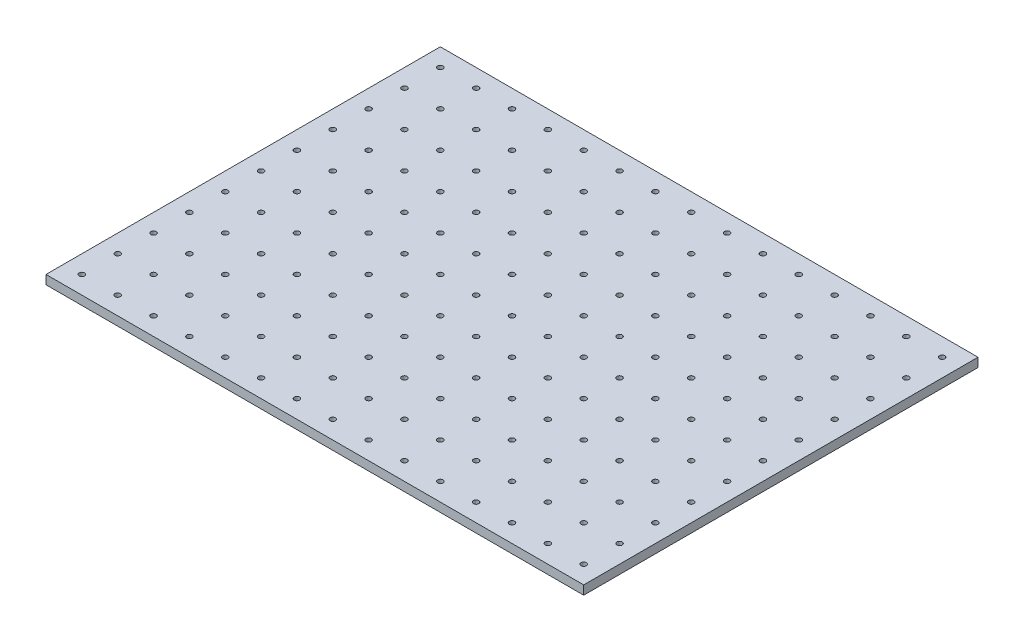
from build123d import *

# Parameters (mm, degrees)
SKETCH1_W           = 300
SKETCH1_H           = 220
SKETCH1_R           = 1.5
BOSS_EXTRUDE1_DEPTH = 5


with BuildPart() as part:
    # Sketch1 → Boss-Extrude1 (new body)
    with BuildSketch(Plane(origin=(0, 0, 0), x_dir=(1, 0, 0), z_dir=(0, 1, 0))):
        Rectangle(SKETCH1_W, SKETCH1_H)
        with Locations(Location((-140, 100, 0), (0, 0, 270))):
            Circle(SKETCH1_R, mode=Mode.SUBTRACT)
        with Locations(Location((-120, 100, 0), (0, 0, 270))):
            Circle(SKETCH1_R, mode=Mode.SUBTRACT)
        with Locations(Location((-100, 100, 0), (0, 0, 270))):
            Circle(SKETCH1_R, mode=Mode.SUBTRACT)
        with Locations(Location((-80, 100, 0), (0, 0, 270))):
            Circle(SKETCH1_R, mode=Mode.SUBTRACT)
        with Locations(Location((-60, 100, 0), (0, 0, 270))):
            Circle(SKETCH1_R, mode=Mode.SUBTRACT)
        with Locations(Location((-40, 100, 0), (0, 0, 270))):
            Circle(SKETCH1_R, mode=Mode.SUBTRACT)
        with Locations(Location((-20, 100, 0), (0, 0, 270))):
            Circle(SKETCH1_R, mode=Mode.SUBTRACT)
        with Locations(Location((0, 100, 0), (0, 0, 270))):
            Circle(SKETCH1_R, mode=Mode.SUBTRACT)
        with Locations(Location((20, 100, 0), (0, 0, 270))):
            Circle(SKETCH1_R, mode=Mode.SUBTRACT)
        with Locations(Location((40, 100, 0), (0, 0, 270))):
            Circle(SKETCH1_R, mode=Mode.SUBTRACT)
        with Locations(Location((60, 100, 0), (0, 0, 270))):
            Circle(SKETCH1_R, mode=Mode.SUBTRACT)
        with Locations(Location((80, 100, 0), (0, 0, 270))):
            Circle(SKETCH1_R, mode=Mode.SUBTRACT)
        with Locations(Location((100, 100, 0), (0, 0, 270))):
            Circle(SKETCH1_R, mode=Mode.SUBTRACT)
        with Locations(Location((120, 100, 0), (0, 0, 270))):
            Circle(SKETCH1_R, mode=Mode.SUBTRACT)
        with Locations(Location((140, 100, 0), (0, 0, 270))):
            Circle(SKETCH1_R, mode=Mode.SUBTRACT)
        with Locations(Location((-120, 80, 0), (0, 0, 270))):
            Circle(SKETCH1_R, mode=Mode.SUBTRACT)
        with Locations(Location((-100, 80, 0), (0, 0, 270))):
            Circle(SKETCH1_R, mode=Mode.SUBTRACT)
        with Locations(Location((-80, 80, 0), (0, 0, 270))):
            Circle(SKETCH1_R, mode=Mode.SUBTRACT)
        with Locations(Location((-60, 80, 0), (0, 0, 270))):
            Circle(SKETCH1_R, mode=Mode.SUBTRACT)
        with Locations(Location((-40, 80, 0), (0, 0, 270))):
            Circle(SKETCH1_R, mode=Mode.SUBTRACT)
        with Locations(Location((-20, 80, 0), (0, 0, 270))):
            Circle(SKETCH1_R, mode=Mode.SUBTRACT)
        with Locations(Location((0, 80, 0), (0, 0, 270))):
            Circle(SKETCH1_R, mode=Mode.SUBTRACT)
        with Locations(Location((20, 80, 0), (0, 0, 270))):
            Circle(SKETCH1_R, mode=Mode.SUBTRACT)
        with Locations(Location((40, 80, 0), (0, 0, 270))):
            Circle(SKETCH1_R, mode=Mode.SUBTRACT)
        with Locations(Location((60, 80, 0), (0, 0, 270))):
            Circle(SKETCH1_R, mode=Mode.SUBTRACT)
        with Locations(Location((80, 80, 0), (0, 0, 270))):
            Circle(SKETCH1_R, mode=Mode.SUBTRACT)
        with Locations(Location((100, 80, 0), (0, 0, 270))):
            Circle(SKETCH1_R, mode=Mode.SUBTRACT)
        with Locations(Location((120, 80, 0), (0, 0, 270))):
            Circle(SKETCH1_R, mode=Mode.SUBTRACT)
        with Locations(Location((140, 80, 0), (0, 0, 270))):
            Circle(SKETCH1_R, mode=Mode.SUBTRACT)
        with Locations(Location((-120, 60, 0), (0, 0, 270))):
            Circle(SKETCH1_R, mode=Mode.SUBTRACT)
        with Locations(Location((-100, 60, 0), (0, 0, 270))):
            Circle(SKETCH1_R, mode=Mode.SUBTRACT)
        with Locations(Location((-80, 60, 0), (0, 0, 270))):
            Circle(SKETCH1_R, mode=Mode.SUBTRACT)
        with Locations(Location((-60, 60, 0), (0, 0, 270))):
            Circle(SKETCH1_R, mode=Mode.SUBTRACT)
        with Locations(Location((-40, 60, 0), (0, 0, 270))):
            Circle(SKETCH1_R, mode=Mode.SUBTRACT)
        with Locations(Location((-20, 60, 0), (0, 0, 270))):
            Circle(SKETCH1_R, mode=Mode.SUBTRACT)
        with Locations(Location((0, 60, 0), (0, 0, 270))):
            Circle(SKETCH1_R, mode=Mode.SUBTRACT)
        with Locations(Location((20, 60, 0), (0, 0, 270))):
            Circle(SKETCH1_R, mode=Mode.SUBTRACT)
        with Locations(Location((40, 60, 0), (0, 0, 270))):
            Circle(SKETCH1_R, mode=Mode.SUBTRACT)
        with Locations(Location((60, 60, 0), (0, 0, 270))):
            Circle(SKETCH1_R, mode=Mode.SUBTRACT)
        with Locations(Location((80, 60, 0), (0, 0, 270))):
            Circle(SKETCH1_R, mode=Mode.SUBTRACT)
        with Locations(Location((100, 60, 0), (0, 0, 270))):
            Circle(SKETCH1_R, mode=Mode.SUBTRACT)
        with Locations(Location((120, 60, 0), (0, 0, 270))):
            Circle(SKETCH1_R, mode=Mode.SUBTRACT)
        with Locations(Location((140, 60, 0), (0, 0, 270))):
            Circle(SKETCH1_R, mode=Mode.SUBTRACT)
        with Locations(Location((-120, 40, 0), (0, 0, 270))):
            Circle(SKETCH1_R, mode=Mode.SUBTRACT)
        with Locations(Location((-100, 40, 0), (0, 0, 270))):
            Circle(SKETCH1_R, mode=Mode.SUBTRACT)
        with Locations(Location((-80, 40, 0), (0, 0, 270))):
            Circle(SKETCH1_R, mode=Mode.SUBTRACT)
        with Locations(Location((-60, 40, 0), (0, 0, 270))):
            Circle(SKETCH1_R, mode=Mode.SUBTRACT)
        with Locations(Location((-40, 40, 0), (0, 0, 270))):
            Circle(SKETCH1_R, mode=Mode.SUBTRACT)
        with Locations(Location((-20, 40, 0), (0, 0, 270))):
            Circle(SKETCH1_R, mode=Mode.SUBTRACT)
        with Locations(Location((0, 40, 0), (0, 0, 270))):
            Circle(SKETCH1_R, mode=Mode.SUBTRACT)
        with Locations(Location((20, 40, 0), (0, 0, 270))):
            Circle(SKETCH1_R, mode=Mode.SUBTRACT)
        with Locations(Location((40, 40, 0), (0, 0, 270))):
            Circle(SKETCH1_R, mode=Mode.SUBTRACT)
        with Locations(Location((60, 40, 0), (0, 0, 270))):
            Circle(SKETCH1_R, mode=Mode.SUBTRACT)
        with Locations(Location((80, 40, 0), (0, 0, 270))):
            Circle(SKETCH1_R, mode=Mode.SUBTRACT)
        with Locations(Location((100, 40, 0), (0, 0, 270))):
            Circle(SKETCH1_R, mode=Mode.SUBTRACT)
        with Locations(Location((120, 40, 0), (0, 0, 270))):
            Circle(SKETCH1_R, mode=Mode.SUBTRACT)
        with Locations(Location((140, 40, 0), (0, 0, 270))):
            Circle(SKETCH1_R, mode=Mode.SUBTRACT)
        with Locations(Location((-120, 20, 0), (0, 0, 270))):
            Circle(SKETCH1_R, mode=Mode.SUBTRACT)
        with Locations(Location((-100, 20, 0), (0, 0, 270))):
            Circle(SKETCH1_R, mode=Mode.SUBTRACT)
        with Locations(Location((-80, 20, 0), (0, 0, 270))):
            Circle(SKETCH1_R, mode=Mode.SUBTRACT)
        with Locations(Location((-60, 20, 0), (0, 0, 270))):
            Circle(SKETCH1_R, mode=Mode.SUBTRACT)
        with Locations(Location((-40, 20, 0), (0, 0, 270))):
            Circle(SKETCH1_R, mode=Mode.SUBTRACT)
        with Locations(Location((-20, 20, 0), (0, 0, 270))):
            Circle(SKETCH1_R, mode=Mode.SUBTRACT)
        with Locations(Location((0, 20, 0), (0, 0, 270))):
            Circle(SKETCH1_R, mode=Mode.SUBTRACT)
        with Locations(Location((20, 20, 0), (0, 0, 270))):
            Circle(SKETCH1_R, mode=Mode.SUBTRACT)
        with Locations(Location((40, 20, 0), (0, 0, 270))):
            Circle(SKETCH1_R, mode=Mode.SUBTRACT)
        with Locations(Location((60, 20, 0), (0, 0, 270))):
            Circle(SKETCH1_R, mode=Mode.SUBTRACT)
        with Locations(Location((80, 20, 0), (0, 0, 270))):
            Circle(SKETCH1_R, mode=Mode.SUBTRACT)
        with Locations(Location((100, 20, 0), (0, 0, 270))):
            Circle(SKETCH1_R, mode=Mode.SUBTRACT)
        with Locations(Location((120, 20, 0), (0, 0, 270))):
            Circle(SKETCH1_R, mode=Mode.SUBTRACT)
        with Locations(Location((140, 20, 0), (0, 0, 270))):
            Circle(SKETCH1_R, mode=Mode.SUBTRACT)
        with Locations(Location((-120, 0, 0), (0, 0, 270))):
            Circle(SKETCH1_R, mode=Mode.SUBTRACT)
        with Locations(Location((-100, 0, 0), (0, 0, 270))):
            Circle(SKETCH1_R, mode=Mode.SUBTRACT)
        with Locations(Location((-80, 0, 0), (0, 0, 270))):
            Circle(SKETCH1_R, mode=Mode.SUBTRACT)
        with Locations(Location((-60, 0, 0), (0, 0, 270))):
            Circle(SKETCH1_R, mode=Mode.SUBTRACT)
        with Locations(Location((-40, 0, 0), (0, 0, 270))):
            Circle(SKETCH1_R, mode=Mode.SUBTRACT)
        with Locations(Location((-20, 0, 0), (0, 0, 270))):
            Circle(SKETCH1_R, mode=Mode.SUBTRACT)
        with Locations(Location((0, 0, 0), (0, 0, 270))):
            Circle(SKETCH1_R, mode=Mode.SUBTRACT)
        with Locations(Location((20, 0, 0), (0, 0, 270))):
            Circle(SKETCH1_R, mode=Mode.SUBTRACT)
        with Locations(Location((40, 0, 0), (0, 0, 270))):
            Circle(SKETCH1_R, mode=Mode.SUBTRACT)
        with Locations(Location((60, 0, 0), (0, 0, 270))):
            Circle(SKETCH1_R, mode=Mode.SUBTRACT)
        with Locations(Location((80, 0, 0), (0, 0, 270))):
            Circle(SKETCH1_R, mode=Mode.SUBTRACT)
        with Locations(Location((100, 0, 0), (0, 0, 270))):
            Circle(SKETCH1_R, mode=Mode.SUBTRACT)
        with Locations(Location((120, 0, 0), (0, 0, 270))):
            Circle(SKETCH1_R, mode=Mode.SUBTRACT)
        with Locations(Location((140, 0, 0), (0, 0, 270))):
            Circle(SKETCH1_R, mode=Mode.SUBTRACT)
        with Locations(Location((-120, -20, 0), (0, 0, 270))):
            Circle(SKETCH1_R, mode=Mode.SUBTRACT)
        with Locations(Location((-100, -20, 0), (0, 0, 270))):
            Circle(SKETCH1_R, mode=Mode.SUBTRACT)
        with Locations(Location((-80, -20, 0), (0, 0, 270))):
            Circle(SKETCH1_R, mode=Mode.SUBTRACT)
        with Locations(Location((-60, -20, 0), (0, 0, 270))):
            Circle(SKETCH1_R, mode=Mode.SUBTRACT)
        with Locations(Location((-40, -20, 0), (0, 0, 270))):
            Circle(SKETCH1_R, mode=Mode.SUBTRACT)
        with Locations(Location((-20, -20, 0), (0, 0, 270))):
            Circle(SKETCH1_R, mode=Mode.SUBTRACT)
        with Locations(Location((0, -20, 0), (0, 0, 270))):
            Circle(SKETCH1_R, mode=Mode.SUBTRACT)
        with Locations(Location((20, -20, 0), (0, 0, 270))):
            Circle(SKETCH1_R, mode=Mode.SUBTRACT)
        with Locations(Location((40, -20, 0), (0, 0, 270))):
            Circle(SKETCH1_R, mode=Mode.SUBTRACT)
        with Locations(Location((60, -20, 0), (0, 0, 270))):
            Circle(SKETCH1_R, mode=Mode.SUBTRACT)
        with Locations(Location((80, -20, 0), (0, 0, 270))):
            Circle(SKETCH1_R, mode=Mode.SUBTRACT)
        with Locations(Location((100, -20, 0), (0, 0, 270))):
            Circle(SKETCH1_R, mode=Mode.SUBTRACT)
        with Locations(Location((120, -20, 0), (0, 0, 270))):
            Circle(SKETCH1_R, mode=Mode.SUBTRACT)
        with Locations(Location((140, -20, 0), (0, 0, 270))):
            Circle(SKETCH1_R, mode=Mode.SUBTRACT)
        with Locations(Location((-120, -40, 0), (0, 0, 270))):
            Circle(SKETCH1_R, mode=Mode.SUBTRACT)
        with Locations(Location((-100, -40, 0), (0, 0, 270))):
            Circle(SKETCH1_R, mode=Mode.SUBTRACT)
        with Locations(Location((-80, -40, 0), (0, 0, 270))):
            Circle(SKETCH1_R, mode=Mode.SUBTRACT)
        with Locations(Location((-60, -40, 0), (0, 0, 270))):
            Circle(SKETCH1_R, mode=Mode.SUBTRACT)
        with Locations(Location((-40, -40, 0), (0, 0, 270))):
            Circle(SKETCH1_R, mode=Mode.SUBTRACT)
        with Locations(Location((-20, -40, 0), (0, 0, 270))):
            Circle(SKETCH1_R, mode=Mode.SUBTRACT)
        with Locations(Location((0, -40, 0), (0, 0, 270))):
            Circle(SKETCH1_R, mode=Mode.SUBTRACT)
        with Locations(Location((20, -40, 0), (0, 0, 270))):
            Circle(SKETCH1_R, mode=Mode.SUBTRACT)
        with Locations(Location((40, -40, 0), (0, 0, 270))):
            Circle(SKETCH1_R, mode=Mode.SUBTRACT)
        with Locations(Location((60, -40, 0), (0, 0, 270))):
            Circle(SKETCH1_R, mode=Mode.SUBTRACT)
        with Locations(Location((80, -40, 0), (0, 0, 270))):
            Circle(SKETCH1_R, mode=Mode.SUBTRACT)
        with Locations(Location((100, -40, 0), (0, 0, 270))):
            Circle(SKETCH1_R, mode=Mode.SUBTRACT)
        with Locations(Location((120, -40, 0), (0, 0, 270))):
            Circle(SKETCH1_R, mode=Mode.SUBTRACT)
        with Locations(Location((140, -40, 0), (0, 0, 270))):
            Circle(SKETCH1_R, mode=Mode.SUBTRACT)
        with Locations(Location((-120, -60, 0), (0, 0, 270))):
            Circle(SKETCH1_R, mode=Mode.SUBTRACT)
        with Locations(Location((-100, -60, 0), (0, 0, 270))):
            Circle(SKETCH1_R, mode=Mode.SUBTRACT)
        with Locations(Location((-80, -60, 0), (0, 0, 270))):
            Circle(SKETCH1_R, mode=Mode.SUBTRACT)
        with Locations(Location((-60, -60, 0), (0, 0, 270))):
            Circle(SKETCH1_R, mode=Mode.SUBTRACT)
        with Locations(Location((-40, -60, 0), (0, 0, 270))):
            Circle(SKETCH1_R, mode=Mode.SUBTRACT)
        with Locations(Location((-20, -60, 0), (0, 0, 270))):
            Circle(SKETCH1_R, mode=Mode.SUBTRACT)
        with Locations(Location((0, -60, 0), (0, 0, 270))):
            Circle(SKETCH1_R, mode=Mode.SUBTRACT)
        with Locations(Location((20, -60, 0), (0, 0, 270))):
            Circle(SKETCH1_R, mode=Mode.SUBTRACT)
        with Locations(Location((40, -60, 0), (0, 0, 270))):
            Circle(SKETCH1_R, mode=Mode.SUBTRACT)
        with Locations(Location((60, -60, 0), (0, 0, 270))):
            Circle(SKETCH1_R, mode=Mode.SUBTRACT)
        with Locations(Location((80, -60, 0), (0, 0, 270))):
            Circle(SKETCH1_R, mode=Mode.SUBTRACT)
        with Locations(Location((100, -60, 0), (0, 0, 270))):
            Circle(SKETCH1_R, mode=Mode.SUBTRACT)
        with Locations(Location((120, -60, 0), (0, 0, 270))):
            Circle(SKETCH1_R, mode=Mode.SUBTRACT)
        with Locations(Location((140, -60, 0), (0, 0, 270))):
            Circle(SKETCH1_R, mode=Mode.SUBTRACT)
        with Locations(Location((-120, -80, 0), (0, 0, 270))):
            Circle(SKETCH1_R, mode=Mode.SUBTRACT)
        with Locations(Location((-100, -80, 0), (0, 0, 270))):
            Circle(SKETCH1_R, mode=Mode.SUBTRACT)
        with Locations(Location((-80, -80, 0), (0, 0, 270))):
            Circle(SKETCH1_R, mode=Mode.SUBTRACT)
        with Locations(Location((-60, -80, 0), (0, 0, 270))):
            Circle(SKETCH1_R, mode=Mode.SUBTRACT)
        with Locations(Location((-40, -80, 0), (0, 0, 270))):
            Circle(SKETCH1_R, mode=Mode.SUBTRACT)
        with Locations(Location((-20, -80, 0), (0, 0, 270))):
            Circle(SKETCH1_R, mode=Mode.SUBTRACT)
        with Locations(Location((0, -80, 0), (0, 0, 270))):
            Circle(SKETCH1_R, mode=Mode.SUBTRACT)
        with Locations(Location((20, -80, 0), (0, 0, 270))):
            Circle(SKETCH1_R, mode=Mode.SUBTRACT)
        with Locations(Location((40, -80, 0), (0, 0, 270))):
            Circle(SKETCH1_R, mode=Mode.SUBTRACT)
        with Locations(Location((60, -80, 0), (0, 0, 270))):
            Circle(SKETCH1_R, mode=Mode.SUBTRACT)
        with Locations(Location((80, -80, 0), (0, 0, 270))):
            Circle(SKETCH1_R, mode=Mode.SUBTRACT)
        with Locations(Location((100, -80, 0), (0, 0, 270))):
            Circle(SKETCH1_R, mode=Mode.SUBTRACT)
        with Locations(Location((120, -80, 0), (0, 0, 270))):
            Circle(SKETCH1_R, mode=Mode.SUBTRACT)
        with Locations(Location((140, -80, 0), (0, 0, 270))):
            Circle(SKETCH1_R, mode=Mode.SUBTRACT)
        with Locations(Location((-120, -100, 0), (0, 0, 270))):
            Circle(SKETCH1_R, mode=Mode.SUBTRACT)
        with Locations(Location((-100, -100, 0), (0, 0, 270))):
            Circle(SKETCH1_R, mode=Mode.SUBTRACT)
        with Locations(Location((-80, -100, 0), (0, 0, 270))):
            Circle(SKETCH1_R, mode=Mode.SUBTRACT)
        with Locations(Location((-60, -100, 0), (0, 0, 270))):
            Circle(SKETCH1_R, mode=Mode.SUBTRACT)
        with Locations(Location((-40, -100, 0), (0, 0, 270))):
            Circle(SKETCH1_R, mode=Mode.SUBTRACT)
        with Locations(Location((-20, -100, 0), (0, 0, 270))):
            Circle(SKETCH1_R, mode=Mode.SUBTRACT)
        with Locations(Location((0, -100, 0), (0, 0, 270))):
            Circle(SKETCH1_R, mode=Mode.SUBTRACT)
        with Locations(Location((20, -100, 0), (0, 0, 270))):
            Circle(SKETCH1_R, mode=Mode.SUBTRACT)
        with Locations(Location((40, -100, 0), (0, 0, 270))):
            Circle(SKETCH1_R, mode=Mode.SUBTRACT)
        with Locations(Location((60, -100, 0), (0, 0, 270))):
            Circle(SKETCH1_R, mode=Mode.SUBTRACT)
        with Locations(Location((80, -100, 0), (0, 0, 270))):
            Circle(SKETCH1_R, mode=Mode.SUBTRACT)
        with Locations(Location((100, -100, 0), (0, 0, 270))):
            Circle(SKETCH1_R, mode=Mode.SUBTRACT)
        with Locations(Location((120, -100, 0), (0, 0, 270))):
            Circle(SKETCH1_R, mode=Mode.SUBTRACT)
        with Locations(Location((140, -100, 0), (0, 0, 270))):
            Circle(SKETCH1_R, mode=Mode.SUBTRACT)
        with Locations(Location((-140, 80, 0), (0, 0, 270))):
            Circle(SKETCH1_R, mode=Mode.SUBTRACT)
        with Locations(Location((-140, 60, 0), (0, 0, 270))):
            Circle(SKETCH1_R, mode=Mode.SUBTRACT)
        with Locations(Location((-140, 40, 0), (0, 0, 270))):
            Circle(SKETCH1_R, mode=Mode.SUBTRACT)
        with Locations(Location((-140, 20, 0), (0, 0, 270))):
            Circle(SKETCH1_R, mode=Mode.SUBTRACT)
        with Locations(Location((-140, 0, 0), (0, 0, 270))):
            Circle(SKETCH1_R, mode=Mode.SUBTRACT)
        with Locations(Location((-140, -20, 0), (0, 0, 270))):
            Circle(SKETCH1_R, mode=Mode.SUBTRACT)
        with Locations(Location((-140, -40, 0), (0, 0, 270))):
            Circle(SKETCH1_R, mode=Mode.SUBTRACT)
        with Locations(Location((-140, -60, 0), (0, 0, 270))):
            Circle(SKETCH1_R, mode=Mode.SUBTRACT)
        with Locations(Location((-140, -80, 0), (0, 0, 270))):
            Circle(SKETCH1_R, mode=Mode.SUBTRACT)
        with Locations(Location((-140, -100, 0), (0, 0, 270))):
            Circle(SKETCH1_R, mode=Mode.SUBTRACT)
    extrude(amount=BOSS_EXTRUDE1_DEPTH)


solid = part.part
